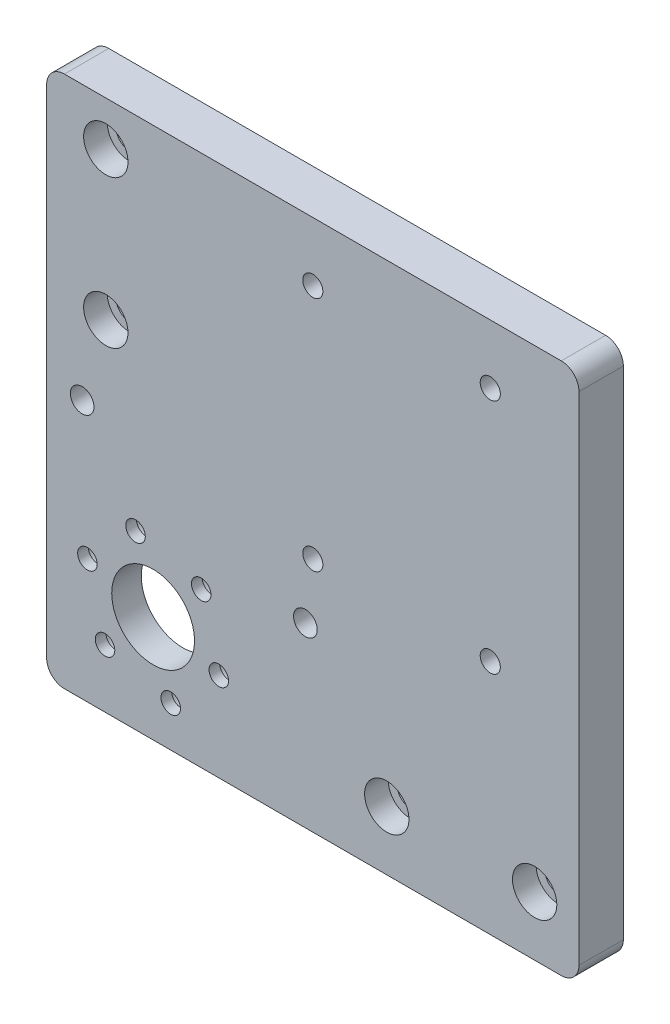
ISO-10303-21;
HEADER;
FILE_DESCRIPTION(('STEP AP214'),'2;1');
FILE_NAME('part.step','',(''),(''),'','','');
FILE_SCHEMA(('AUTOMOTIVE_DESIGN { 1 0 10303 214 1 1 1 1 }'));
ENDSEC;
DATA;
#1=APPLICATION_CONTEXT('core data for automotive mechanical design processes');
#2=APPLICATION_PROTOCOL_DEFINITION('international standard','automotive_design',2000,#1);
#3=PRODUCT_CONTEXT('',#1,'mechanical');
#4=PRODUCT('Part','Part','',(#3));
#5=PRODUCT_RELATED_PRODUCT_CATEGORY('part','',(#4));
#6=PRODUCT_DEFINITION_FORMATION('','',#4);
#7=PRODUCT_DEFINITION_CONTEXT('part definition',#1,'design');
#8=PRODUCT_DEFINITION('design','',#6,#7);
#9=PRODUCT_DEFINITION_SHAPE('','',#8);
#10=(LENGTH_UNIT() NAMED_UNIT(*) SI_UNIT(.MILLI.,.METRE.));
#11=(NAMED_UNIT(*) PLANE_ANGLE_UNIT() SI_UNIT($,.RADIAN.));
#12=(NAMED_UNIT(*) SI_UNIT($,.STERADIAN.) SOLID_ANGLE_UNIT());
#13=UNCERTAINTY_MEASURE_WITH_UNIT(LENGTH_MEASURE(1.E-05),#10,'distance_accuracy_value','');
#14=(GEOMETRIC_REPRESENTATION_CONTEXT(3) GLOBAL_UNCERTAINTY_ASSIGNED_CONTEXT((#13)) GLOBAL_UNIT_ASSIGNED_CONTEXT((#10,
#11,#12)) REPRESENTATION_CONTEXT('',''));
#15=CARTESIAN_POINT('',(0.,0.,0.));
#16=DIRECTION('',(0.,0.,1.));
#17=DIRECTION('',(1.,0.,0.));
#18=AXIS2_PLACEMENT_3D('',#15,#16,#17);
#19=CARTESIAN_POINT('',(-106.216294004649,-78.0471619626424,5.));
#20=DIRECTION('',(0.,0.,-1.));
#21=DIRECTION('',(-1.,0.,0.));
#22=AXIS2_PLACEMENT_3D('',#19,#20,#21);
#23=CYLINDRICAL_SURFACE('',#22,5.50000000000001);
#24=CARTESIAN_POINT('',(-106.216294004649,-78.0471619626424,5.));
#25=DIRECTION('',(0.,0.,-1.));
#26=DIRECTION('',(-1.,0.,0.));
#27=AXIS2_PLACEMENT_3D('',#24,#25,#26);
#28=CIRCLE('',#27,5.50000000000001);
#29=CARTESIAN_POINT('',(-111.716294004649,-78.0471619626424,5.));
#30=VERTEX_POINT('',#29);
#31=EDGE_CURVE('E148',#30,#30,#28,.F.);
#32=ORIENTED_EDGE('',*,*,#31,.F.);
#33=EDGE_LOOP('',(#32));
#34=FACE_BOUND('',#33,.T.);
#35=CARTESIAN_POINT('',(-106.216294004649,-78.0471619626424,11.4));
#36=DIRECTION('',(0.,0.,-1.));
#37=DIRECTION('',(-1.,0.,0.));
#38=AXIS2_PLACEMENT_3D('',#35,#36,#37);
#39=CIRCLE('',#38,5.50000000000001);
#40=CARTESIAN_POINT('',(-111.716294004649,-78.0471619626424,11.4));
#41=VERTEX_POINT('',#40);
#42=EDGE_CURVE('E165',#41,#41,#39,.F.);
#43=ORIENTED_EDGE('',*,*,#42,.T.);
#44=EDGE_LOOP('',(#43));
#45=FACE_BOUND('',#44,.T.);
#46=ADVANCED_FACE('F16',(#34,#45),#23,.F.);
#47=CARTESIAN_POINT('',(-100.263455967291,-100.263455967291,5.));
#48=DIRECTION('',(0.,0.,-1.));
#49=DIRECTION('',(-1.,0.,0.));
#50=AXIS2_PLACEMENT_3D('',#47,#48,#49);
#51=CYLINDRICAL_SURFACE('',#50,5.50000000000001);
#52=CARTESIAN_POINT('',(-100.263455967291,-100.263455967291,5.));
#53=DIRECTION('',(0.,0.,-1.));
#54=DIRECTION('',(-1.,0.,0.));
#55=AXIS2_PLACEMENT_3D('',#52,#53,#54);
#56=CIRCLE('',#55,5.50000000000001);
#57=CARTESIAN_POINT('',(-105.763455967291,-100.263455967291,5.));
#58=VERTEX_POINT('',#57);
#59=EDGE_CURVE('E145',#58,#58,#56,.F.);
#60=ORIENTED_EDGE('',*,*,#59,.F.);
#61=EDGE_LOOP('',(#60));
#62=FACE_BOUND('',#61,.T.);
#63=CARTESIAN_POINT('',(-100.263455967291,-100.263455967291,11.4));
#64=DIRECTION('',(0.,0.,-1.));
#65=DIRECTION('',(-1.,0.,0.));
#66=AXIS2_PLACEMENT_3D('',#63,#64,#65);
#67=CIRCLE('',#66,5.50000000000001);
#68=CARTESIAN_POINT('',(-105.763455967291,-100.263455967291,11.4));
#69=VERTEX_POINT('',#68);
#70=EDGE_CURVE('E162',#69,#69,#67,.F.);
#71=ORIENTED_EDGE('',*,*,#70,.T.);
#72=EDGE_LOOP('',(#71));
#73=FACE_BOUND('',#72,.T.);
#74=ADVANCED_FACE('F613',(#62,#73),#51,.F.);
#75=CARTESIAN_POINT('',(-78.047161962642,-106.216294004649,5.));
#76=DIRECTION('',(0.,0.,-1.));
#77=DIRECTION('',(-1.,0.,0.));
#78=AXIS2_PLACEMENT_3D('',#75,#76,#77);
#79=CYLINDRICAL_SURFACE('',#78,5.49999999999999);
#80=CARTESIAN_POINT('',(-78.047161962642,-106.216294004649,5.));
#81=DIRECTION('',(0.,0.,-1.));
#82=DIRECTION('',(-1.,0.,0.));
#83=AXIS2_PLACEMENT_3D('',#80,#81,#82);
#84=CIRCLE('',#83,5.49999999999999);
#85=CARTESIAN_POINT('',(-83.547161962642,-106.216294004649,5.));
#86=VERTEX_POINT('',#85);
#87=EDGE_CURVE('E142',#86,#86,#84,.F.);
#88=ORIENTED_EDGE('',*,*,#87,.F.);
#89=EDGE_LOOP('',(#88));
#90=FACE_BOUND('',#89,.T.);
#91=CARTESIAN_POINT('',(-78.047161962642,-106.216294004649,11.4));
#92=DIRECTION('',(0.,0.,-1.));
#93=DIRECTION('',(-1.,0.,0.));
#94=AXIS2_PLACEMENT_3D('',#91,#92,#93);
#95=CIRCLE('',#94,5.49999999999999);
#96=CARTESIAN_POINT('',(-83.547161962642,-106.216294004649,11.4));
#97=VERTEX_POINT('',#96);
#98=EDGE_CURVE('E159',#97,#97,#95,.F.);
#99=ORIENTED_EDGE('',*,*,#98,.T.);
#100=EDGE_LOOP('',(#99));
#101=FACE_BOUND('',#100,.T.);
#102=ADVANCED_FACE('F610',(#90,#101),#79,.F.);
#103=CARTESIAN_POINT('',(-61.7837059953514,-89.9528380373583,5.));
#104=DIRECTION('',(0.,0.,-1.));
#105=DIRECTION('',(-1.,0.,0.));
#106=AXIS2_PLACEMENT_3D('',#103,#104,#105);
#107=CYLINDRICAL_SURFACE('',#106,5.5);
#108=CARTESIAN_POINT('',(-61.7837059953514,-89.9528380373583,5.));
#109=DIRECTION('',(0.,0.,-1.));
#110=DIRECTION('',(-1.,0.,0.));
#111=AXIS2_PLACEMENT_3D('',#108,#109,#110);
#112=CIRCLE('',#111,5.5);
#113=CARTESIAN_POINT('',(-67.2837059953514,-89.9528380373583,5.));
#114=VERTEX_POINT('',#113);
#115=EDGE_CURVE('E139',#114,#114,#112,.F.);
#116=ORIENTED_EDGE('',*,*,#115,.F.);
#117=EDGE_LOOP('',(#116));
#118=FACE_BOUND('',#117,.T.);
#119=CARTESIAN_POINT('',(-61.7837059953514,-89.9528380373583,11.4));
#120=DIRECTION('',(0.,0.,-1.));
#121=DIRECTION('',(-1.,0.,0.));
#122=AXIS2_PLACEMENT_3D('',#119,#120,#121);
#123=CIRCLE('',#122,5.5);
#124=CARTESIAN_POINT('',(-67.2837059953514,-89.9528380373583,11.4));
#125=VERTEX_POINT('',#124);
#126=EDGE_CURVE('E156',#125,#125,#123,.F.);
#127=ORIENTED_EDGE('',*,*,#126,.T.);
#128=EDGE_LOOP('',(#127));
#129=FACE_BOUND('',#128,.T.);
#130=ADVANCED_FACE('F606',(#118,#129),#107,.F.);
#131=CARTESIAN_POINT('',(-67.7365440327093,-67.7365440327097,5.));
#132=DIRECTION('',(0.,0.,-1.));
#133=DIRECTION('',(-1.,0.,0.));
#134=AXIS2_PLACEMENT_3D('',#131,#132,#133);
#135=CYLINDRICAL_SURFACE('',#134,5.50000000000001);
#136=CARTESIAN_POINT('',(-67.7365440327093,-67.7365440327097,5.));
#137=DIRECTION('',(0.,0.,-1.));
#138=DIRECTION('',(-1.,0.,0.));
#139=AXIS2_PLACEMENT_3D('',#136,#137,#138);
#140=CIRCLE('',#139,5.50000000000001);
#141=CARTESIAN_POINT('',(-73.2365440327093,-67.7365440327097,5.));
#142=VERTEX_POINT('',#141);
#143=EDGE_CURVE('E136',#142,#142,#140,.F.);
#144=ORIENTED_EDGE('',*,*,#143,.F.);
#145=EDGE_LOOP('',(#144));
#146=FACE_BOUND('',#145,.T.);
#147=CARTESIAN_POINT('',(-67.7365440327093,-67.7365440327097,11.4));
#148=DIRECTION('',(0.,0.,-1.));
#149=DIRECTION('',(-1.,0.,0.));
#150=AXIS2_PLACEMENT_3D('',#147,#148,#149);
#151=CIRCLE('',#150,5.50000000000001);
#152=CARTESIAN_POINT('',(-73.2365440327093,-67.7365440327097,11.4));
#153=VERTEX_POINT('',#152);
#154=EDGE_CURVE('E153',#153,#153,#151,.F.);
#155=ORIENTED_EDGE('',*,*,#154,.T.);
#156=EDGE_LOOP('',(#155));
#157=FACE_BOUND('',#156,.T.);
#158=ADVANCED_FACE('F599',(#146,#157),#135,.F.);
#159=CARTESIAN_POINT('',(-89.952838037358,-61.7837059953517,5.));
#160=DIRECTION('',(0.,0.,-1.));
#161=DIRECTION('',(-1.,0.,0.));
#162=AXIS2_PLACEMENT_3D('',#159,#160,#161);
#163=CYLINDRICAL_SURFACE('',#162,5.50000000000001);
#164=CARTESIAN_POINT('',(-89.952838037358,-61.7837059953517,5.));
#165=DIRECTION('',(0.,0.,-1.));
#166=DIRECTION('',(-1.,0.,0.));
#167=AXIS2_PLACEMENT_3D('',#164,#165,#166);
#168=CIRCLE('',#167,5.50000000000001);
#169=CARTESIAN_POINT('',(-95.452838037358,-61.7837059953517,5.));
#170=VERTEX_POINT('',#169);
#171=EDGE_CURVE('E129',#170,#170,#168,.F.);
#172=ORIENTED_EDGE('',*,*,#171,.F.);
#173=EDGE_LOOP('',(#172));
#174=FACE_BOUND('',#173,.T.);
#175=CARTESIAN_POINT('',(-89.952838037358,-61.7837059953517,11.4));
#176=DIRECTION('',(0.,0.,-1.));
#177=DIRECTION('',(-1.,0.,0.));
#178=AXIS2_PLACEMENT_3D('',#175,#176,#177);
#179=CIRCLE('',#178,5.50000000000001);
#180=CARTESIAN_POINT('',(-95.452838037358,-61.7837059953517,11.4));
#181=VERTEX_POINT('',#180);
#182=EDGE_CURVE('E111',#181,#181,#179,.F.);
#183=ORIENTED_EDGE('',*,*,#182,.T.);
#184=EDGE_LOOP('',(#183));
#185=FACE_BOUND('',#184,.T.);
#186=ADVANCED_FACE('F592',(#174,#185),#163,.F.);
#187=CARTESIAN_POINT('',(-100.,-4.9999999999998,15.));
#188=DIRECTION('',(0.,0.,-1.));
#189=DIRECTION('',(-1.,0.,0.));
#190=AXIS2_PLACEMENT_3D('',#187,#188,#189);
#191=CYLINDRICAL_SURFACE('',#190,4.5);
#192=CARTESIAN_POINT('',(-100.,-4.9999999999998,0.));
#193=DIRECTION('',(0.,0.,-1.));
#194=DIRECTION('',(-1.,0.,0.));
#195=AXIS2_PLACEMENT_3D('',#192,#193,#194);
#196=CIRCLE('',#195,4.5);
#197=CARTESIAN_POINT('',(-104.5,-4.9999999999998,0.));
#198=VERTEX_POINT('',#197);
#199=EDGE_CURVE('E122',#198,#198,#196,.T.);
#200=ORIENTED_EDGE('',*,*,#199,.T.);
#201=EDGE_LOOP('',(#200));
#202=FACE_BOUND('',#201,.T.);
#203=CARTESIAN_POINT('',(-100.,-4.9999999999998,7.));
#204=DIRECTION('',(0.,0.,-1.));
#205=DIRECTION('',(-1.,0.,0.));
#206=AXIS2_PLACEMENT_3D('',#203,#204,#205);
#207=CIRCLE('',#206,4.5);
#208=CARTESIAN_POINT('',(-104.5,-4.9999999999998,7.));
#209=VERTEX_POINT('',#208);
#210=EDGE_CURVE('E171',#209,#209,#207,.T.);
#211=ORIENTED_EDGE('',*,*,#210,.F.);
#212=EDGE_LOOP('',(#211));
#213=FACE_BOUND('',#212,.T.);
#214=ADVANCED_FACE('F381',(#202,#213),#191,.F.);
#215=CARTESIAN_POINT('',(-4.99999999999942,-100.,15.));
#216=DIRECTION('',(0.,0.,-1.));
#217=DIRECTION('',(-1.,0.,0.));
#218=AXIS2_PLACEMENT_3D('',#215,#216,#217);
#219=CYLINDRICAL_SURFACE('',#218,4.50000000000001);
#220=CARTESIAN_POINT('',(-4.99999999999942,-100.,0.));
#221=DIRECTION('',(0.,0.,-1.));
#222=DIRECTION('',(-1.,0.,0.));
#223=AXIS2_PLACEMENT_3D('',#220,#221,#222);
#224=CIRCLE('',#223,4.50000000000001);
#225=CARTESIAN_POINT('',(-9.49999999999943,-100.,0.));
#226=VERTEX_POINT('',#225);
#227=EDGE_CURVE('E373',#226,#226,#224,.T.);
#228=ORIENTED_EDGE('',*,*,#227,.T.);
#229=EDGE_LOOP('',(#228));
#230=FACE_BOUND('',#229,.T.);
#231=CARTESIAN_POINT('',(-4.99999999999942,-100.,7.));
#232=DIRECTION('',(0.,0.,-1.));
#233=DIRECTION('',(-1.,0.,0.));
#234=AXIS2_PLACEMENT_3D('',#231,#232,#233);
#235=CIRCLE('',#234,4.50000000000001);
#236=CARTESIAN_POINT('',(-9.49999999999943,-100.,7.));
#237=VERTEX_POINT('',#236);
#238=EDGE_CURVE('E173',#237,#237,#235,.T.);
#239=ORIENTED_EDGE('',*,*,#238,.F.);
#240=EDGE_LOOP('',(#239));
#241=FACE_BOUND('',#240,.T.);
#242=ADVANCED_FACE('F591',(#230,#241),#219,.F.);
#243=CARTESIAN_POINT('',(-64.,-64.0000000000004,5.));
#244=DIRECTION('',(0.,0.,-1.));
#245=DIRECTION('',(-1.,0.,0.));
#246=AXIS2_PLACEMENT_3D('',#243,#244,#245);
#247=CYLINDRICAL_SURFACE('',#246,15.);
#248=DIRECTION('',(0.,0.,-1.));
#249=VECTOR('',#248,1.);
#250=CARTESIAN_POINT('',(-49.,-64.0000000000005,5.));
#251=LINE('',#250,#249);
#252=CARTESIAN_POINT('',(-49.,-64.0000000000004,0.));
#253=VERTEX_POINT('',#252);
#254=CARTESIAN_POINT('',(-49.,-64.0000000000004,5.));
#255=VERTEX_POINT('',#254);
#256=EDGE_CURVE('E100',#253,#255,#251,.F.);
#257=ORIENTED_EDGE('',*,*,#256,.T.);
#258=CARTESIAN_POINT('',(-64.,-64.0000000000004,5.));
#259=DIRECTION('',(0.,0.,-1.));
#260=DIRECTION('',(-1.,0.,0.));
#261=AXIS2_PLACEMENT_3D('',#258,#259,#260);
#262=CIRCLE('',#261,15.);
#263=CARTESIAN_POINT('',(-64.0000000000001,-49.0000000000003,5.));
#264=VERTEX_POINT('',#263);
#265=EDGE_CURVE('E104',#264,#255,#262,.T.);
#266=ORIENTED_EDGE('',*,*,#265,.F.);
#267=DIRECTION('',(0.,0.,1.));
#268=VECTOR('',#267,1.);
#269=CARTESIAN_POINT('',(-64.0000000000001,-49.0000000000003,5.));
#270=LINE('',#269,#268);
#271=CARTESIAN_POINT('',(-64.0000000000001,-49.0000000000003,0.));
#272=VERTEX_POINT('',#271);
#273=EDGE_CURVE('E95',#264,#272,#270,.F.);
#274=ORIENTED_EDGE('',*,*,#273,.T.);
#275=CARTESIAN_POINT('',(-64.,-64.0000000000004,0.));
#276=DIRECTION('',(0.,0.,-1.));
#277=DIRECTION('',(-1.,0.,0.));
#278=AXIS2_PLACEMENT_3D('',#275,#276,#277);
#279=CIRCLE('',#278,15.);
#280=EDGE_CURVE('E107',#272,#253,#279,.T.);
#281=ORIENTED_EDGE('',*,*,#280,.T.);
#282=EDGE_LOOP('',(#257,#266,#274,#281));
#283=FACE_BOUND('',#282,.T.);
#284=ADVANCED_FACE('F102',(#283),#247,.F.);
#285=CARTESIAN_POINT('',(-100.,45.0000000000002,15.));
#286=DIRECTION('',(0.,0.,-1.));
#287=DIRECTION('',(-1.,0.,0.));
#288=AXIS2_PLACEMENT_3D('',#285,#286,#287);
#289=CYLINDRICAL_SURFACE('',#288,4.5);
#290=CARTESIAN_POINT('',(-100.,45.0000000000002,0.));
#291=DIRECTION('',(0.,0.,-1.));
#292=DIRECTION('',(-1.,0.,0.));
#293=AXIS2_PLACEMENT_3D('',#290,#291,#292);
#294=CIRCLE('',#293,4.5);
#295=CARTESIAN_POINT('',(-104.5,45.0000000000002,0.));
#296=VERTEX_POINT('',#295);
#297=EDGE_CURVE('E368',#296,#296,#294,.T.);
#298=ORIENTED_EDGE('',*,*,#297,.T.);
#299=EDGE_LOOP('',(#298));
#300=FACE_BOUND('',#299,.T.);
#301=CARTESIAN_POINT('',(-100.,45.0000000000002,7.));
#302=DIRECTION('',(0.,0.,-1.));
#303=DIRECTION('',(-1.,0.,0.));
#304=AXIS2_PLACEMENT_3D('',#301,#302,#303);
#305=CIRCLE('',#304,4.5);
#306=CARTESIAN_POINT('',(-104.5,45.0000000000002,7.));
#307=VERTEX_POINT('',#306);
#308=EDGE_CURVE('E168',#307,#307,#305,.T.);
#309=ORIENTED_EDGE('',*,*,#308,.F.);
#310=EDGE_LOOP('',(#309));
#311=FACE_BOUND('',#310,.T.);
#312=ADVANCED_FACE('F184',(#300,#311),#289,.F.);
#313=CARTESIAN_POINT('',(45.0000000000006,-99.9999999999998,15.));
#314=DIRECTION('',(0.,0.,-1.));
#315=DIRECTION('',(-1.,0.,0.));
#316=AXIS2_PLACEMENT_3D('',#313,#314,#315);
#317=CYLINDRICAL_SURFACE('',#316,4.49999999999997);
#318=CARTESIAN_POINT('',(45.0000000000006,-99.9999999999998,0.));
#319=DIRECTION('',(0.,0.,-1.));
#320=DIRECTION('',(-1.,0.,0.));
#321=AXIS2_PLACEMENT_3D('',#318,#319,#320);
#322=CIRCLE('',#321,4.49999999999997);
#323=CARTESIAN_POINT('',(40.5000000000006,-99.9999999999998,0.));
#324=VERTEX_POINT('',#323);
#325=EDGE_CURVE('E363',#324,#324,#322,.T.);
#326=ORIENTED_EDGE('',*,*,#325,.T.);
#327=EDGE_LOOP('',(#326));
#328=FACE_BOUND('',#327,.T.);
#329=CARTESIAN_POINT('',(45.0000000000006,-99.9999999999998,7.));
#330=DIRECTION('',(0.,0.,-1.));
#331=DIRECTION('',(-1.,0.,0.));
#332=AXIS2_PLACEMENT_3D('',#329,#330,#331);
#333=CIRCLE('',#332,4.49999999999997);
#334=CARTESIAN_POINT('',(40.5000000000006,-99.9999999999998,7.));
#335=VERTEX_POINT('',#334);
#336=EDGE_CURVE('E19',#335,#335,#333,.T.);
#337=ORIENTED_EDGE('',*,*,#336,.F.);
#338=EDGE_LOOP('',(#337));
#339=FACE_BOUND('',#338,.T.);
#340=ADVANCED_FACE('F182',(#328,#339),#317,.F.);
#341=CARTESIAN_POINT('',(45.0000000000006,-99.9999999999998,7.));
#342=DIRECTION('',(0.,0.,1.));
#343=DIRECTION('',(1.,0.,0.));
#344=AXIS2_PLACEMENT_3D('',#341,#342,#343);
#345=PLANE('',#344);
#346=CARTESIAN_POINT('',(45.0000000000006,-99.9999999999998,7.));
#347=DIRECTION('',(0.,0.,1.));
#348=DIRECTION('',(1.,0.,0.));
#349=AXIS2_PLACEMENT_3D('',#346,#347,#348);
#350=CIRCLE('',#349,7.5);
#351=CARTESIAN_POINT('',(52.5000000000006,-99.9999999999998,7.));
#352=VERTEX_POINT('',#351);
#353=EDGE_CURVE('E357',#352,#352,#350,.T.);
#354=ORIENTED_EDGE('',*,*,#353,.T.);
#355=EDGE_LOOP('',(#354));
#356=FACE_BOUND('',#355,.T.);
#357=ORIENTED_EDGE('',*,*,#336,.T.);
#358=EDGE_LOOP('',(#357));
#359=FACE_BOUND('',#358,.T.);
#360=ADVANCED_FACE('F180',(#356,#359),#345,.T.);
#361=CARTESIAN_POINT('',(-4.99999999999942,-100.,7.));
#362=DIRECTION('',(0.,0.,1.));
#363=DIRECTION('',(1.,0.,0.));
#364=AXIS2_PLACEMENT_3D('',#361,#362,#363);
#365=PLANE('',#364);
#366=CARTESIAN_POINT('',(-4.99999999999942,-100.,7.));
#367=DIRECTION('',(0.,0.,1.));
#368=DIRECTION('',(1.,0.,0.));
#369=AXIS2_PLACEMENT_3D('',#366,#367,#368);
#370=CIRCLE('',#369,7.5);
#371=CARTESIAN_POINT('',(2.50000000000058,-100.,7.));
#372=VERTEX_POINT('',#371);
#373=EDGE_CURVE('E354',#372,#372,#370,.T.);
#374=ORIENTED_EDGE('',*,*,#373,.T.);
#375=EDGE_LOOP('',(#374));
#376=FACE_BOUND('',#375,.T.);
#377=ORIENTED_EDGE('',*,*,#238,.T.);
#378=EDGE_LOOP('',(#377));
#379=FACE_BOUND('',#378,.T.);
#380=ADVANCED_FACE('F192',(#376,#379),#365,.T.);
#381=CARTESIAN_POINT('',(-100.,-4.9999999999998,7.));
#382=DIRECTION('',(0.,0.,1.));
#383=DIRECTION('',(1.,0.,0.));
#384=AXIS2_PLACEMENT_3D('',#381,#382,#383);
#385=PLANE('',#384);
#386=CARTESIAN_POINT('',(-100.,-4.9999999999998,7.));
#387=DIRECTION('',(0.,0.,1.));
#388=DIRECTION('',(1.,0.,0.));
#389=AXIS2_PLACEMENT_3D('',#386,#387,#388);
#390=CIRCLE('',#389,7.49999999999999);
#391=CARTESIAN_POINT('',(-92.5,-4.9999999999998,7.));
#392=VERTEX_POINT('',#391);
#393=EDGE_CURVE('E356',#392,#392,#390,.T.);
#394=ORIENTED_EDGE('',*,*,#393,.T.);
#395=EDGE_LOOP('',(#394));
#396=FACE_BOUND('',#395,.T.);
#397=ORIENTED_EDGE('',*,*,#210,.T.);
#398=EDGE_LOOP('',(#397));
#399=FACE_BOUND('',#398,.T.);
#400=ADVANCED_FACE('F343',(#396,#399),#385,.T.);
#401=CARTESIAN_POINT('',(-100.,45.0000000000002,7.));
#402=DIRECTION('',(0.,0.,1.));
#403=DIRECTION('',(1.,0.,0.));
#404=AXIS2_PLACEMENT_3D('',#401,#402,#403);
#405=PLANE('',#404);
#406=CARTESIAN_POINT('',(-100.,45.0000000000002,7.));
#407=DIRECTION('',(0.,0.,1.));
#408=DIRECTION('',(1.,0.,0.));
#409=AXIS2_PLACEMENT_3D('',#406,#407,#408);
#410=CIRCLE('',#409,7.49999999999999);
#411=CARTESIAN_POINT('',(-92.5,45.0000000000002,7.));
#412=VERTEX_POINT('',#411);
#413=EDGE_CURVE('E360',#412,#412,#410,.T.);
#414=ORIENTED_EDGE('',*,*,#413,.T.);
#415=EDGE_LOOP('',(#414));
#416=FACE_BOUND('',#415,.T.);
#417=ORIENTED_EDGE('',*,*,#308,.T.);
#418=EDGE_LOOP('',(#417));
#419=FACE_BOUND('',#418,.T.);
#420=ADVANCED_FACE('F339',(#416,#419),#405,.T.);
#421=CARTESIAN_POINT('',(-102.916294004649,-78.0471619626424,11.4));
#422=DIRECTION('',(0.,0.,1.));
#423=DIRECTION('',(1.,0.,0.));
#424=AXIS2_PLACEMENT_3D('',#421,#422,#423);
#425=PLANE('',#424);
#426=ORIENTED_EDGE('',*,*,#42,.F.);
#427=EDGE_LOOP('',(#426));
#428=FACE_BOUND('',#427,.T.);
#429=CARTESIAN_POINT('',(-106.216294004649,-78.0471619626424,11.4));
#430=DIRECTION('',(0.,0.,-1.));
#431=DIRECTION('',(-1.,0.,0.));
#432=AXIS2_PLACEMENT_3D('',#429,#430,#431);
#433=CIRCLE('',#432,3.3);
#434=CARTESIAN_POINT('',(-109.516294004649,-78.0471619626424,11.4));
#435=VERTEX_POINT('',#434);
#436=EDGE_CURVE('E424',#435,#435,#433,.F.);
#437=ORIENTED_EDGE('',*,*,#436,.T.);
#438=EDGE_LOOP('',(#437));
#439=FACE_BOUND('',#438,.T.);
#440=ADVANCED_FACE('F335',(#428,#439),#425,.F.);
#441=CARTESIAN_POINT('',(-96.9634559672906,-100.263455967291,11.4));
#442=DIRECTION('',(0.,0.,1.));
#443=DIRECTION('',(1.,0.,0.));
#444=AXIS2_PLACEMENT_3D('',#441,#442,#443);
#445=PLANE('',#444);
#446=ORIENTED_EDGE('',*,*,#70,.F.);
#447=EDGE_LOOP('',(#446));
#448=FACE_BOUND('',#447,.T.);
#449=CARTESIAN_POINT('',(-100.263455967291,-100.263455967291,11.4));
#450=DIRECTION('',(0.,0.,-1.));
#451=DIRECTION('',(-1.,0.,0.));
#452=AXIS2_PLACEMENT_3D('',#449,#450,#451);
#453=CIRCLE('',#452,3.3);
#454=CARTESIAN_POINT('',(-103.563455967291,-100.263455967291,11.4));
#455=VERTEX_POINT('',#454);
#456=EDGE_CURVE('E421',#455,#455,#453,.F.);
#457=ORIENTED_EDGE('',*,*,#456,.T.);
#458=EDGE_LOOP('',(#457));
#459=FACE_BOUND('',#458,.T.);
#460=ADVANCED_FACE('F331',(#448,#459),#445,.F.);
#461=CARTESIAN_POINT('',(-74.747161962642,-106.216294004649,11.4));
#462=DIRECTION('',(0.,0.,1.));
#463=DIRECTION('',(1.,0.,0.));
#464=AXIS2_PLACEMENT_3D('',#461,#462,#463);
#465=PLANE('',#464);
#466=ORIENTED_EDGE('',*,*,#98,.F.);
#467=EDGE_LOOP('',(#466));
#468=FACE_BOUND('',#467,.T.);
#469=CARTESIAN_POINT('',(-78.047161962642,-106.216294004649,11.4));
#470=DIRECTION('',(0.,0.,-1.));
#471=DIRECTION('',(-1.,0.,0.));
#472=AXIS2_PLACEMENT_3D('',#469,#470,#471);
#473=CIRCLE('',#472,3.3);
#474=CARTESIAN_POINT('',(-81.347161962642,-106.216294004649,11.4));
#475=VERTEX_POINT('',#474);
#476=EDGE_CURVE('E418',#475,#475,#473,.F.);
#477=ORIENTED_EDGE('',*,*,#476,.T.);
#478=EDGE_LOOP('',(#477));
#479=FACE_BOUND('',#478,.T.);
#480=ADVANCED_FACE('F327',(#468,#479),#465,.F.);
#481=CARTESIAN_POINT('',(-58.4837059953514,-89.9528380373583,11.4));
#482=DIRECTION('',(0.,0.,1.));
#483=DIRECTION('',(1.,0.,0.));
#484=AXIS2_PLACEMENT_3D('',#481,#482,#483);
#485=PLANE('',#484);
#486=ORIENTED_EDGE('',*,*,#126,.F.);
#487=EDGE_LOOP('',(#486));
#488=FACE_BOUND('',#487,.T.);
#489=CARTESIAN_POINT('',(-61.7837059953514,-89.9528380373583,11.4));
#490=DIRECTION('',(0.,0.,-1.));
#491=DIRECTION('',(-1.,0.,0.));
#492=AXIS2_PLACEMENT_3D('',#489,#490,#491);
#493=CIRCLE('',#492,3.3);
#494=CARTESIAN_POINT('',(-65.0837059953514,-89.9528380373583,11.4));
#495=VERTEX_POINT('',#494);
#496=EDGE_CURVE('E415',#495,#495,#493,.F.);
#497=ORIENTED_EDGE('',*,*,#496,.T.);
#498=EDGE_LOOP('',(#497));
#499=FACE_BOUND('',#498,.T.);
#500=ADVANCED_FACE('F323',(#488,#499),#485,.F.);
#501=CARTESIAN_POINT('',(-64.4365440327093,-67.7365440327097,11.4));
#502=DIRECTION('',(0.,0.,1.));
#503=DIRECTION('',(1.,0.,0.));
#504=AXIS2_PLACEMENT_3D('',#501,#502,#503);
#505=PLANE('',#504);
#506=ORIENTED_EDGE('',*,*,#154,.F.);
#507=EDGE_LOOP('',(#506));
#508=FACE_BOUND('',#507,.T.);
#509=CARTESIAN_POINT('',(-67.7365440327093,-67.7365440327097,11.4));
#510=DIRECTION('',(0.,0.,-1.));
#511=DIRECTION('',(-1.,0.,0.));
#512=AXIS2_PLACEMENT_3D('',#509,#510,#511);
#513=CIRCLE('',#512,3.3);
#514=CARTESIAN_POINT('',(-71.0365440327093,-67.7365440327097,11.4));
#515=VERTEX_POINT('',#514);
#516=EDGE_CURVE('E409',#515,#515,#513,.F.);
#517=ORIENTED_EDGE('',*,*,#516,.T.);
#518=EDGE_LOOP('',(#517));
#519=FACE_BOUND('',#518,.T.);
#520=ADVANCED_FACE('F319',(#508,#519),#505,.F.);
#521=CARTESIAN_POINT('',(-86.652838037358,-61.7837059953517,11.4));
#522=DIRECTION('',(0.,0.,1.));
#523=DIRECTION('',(1.,0.,0.));
#524=AXIS2_PLACEMENT_3D('',#521,#522,#523);
#525=PLANE('',#524);
#526=ORIENTED_EDGE('',*,*,#182,.F.);
#527=EDGE_LOOP('',(#526));
#528=FACE_BOUND('',#527,.T.);
#529=CARTESIAN_POINT('',(-89.952838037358,-61.7837059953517,11.4));
#530=DIRECTION('',(0.,0.,-1.));
#531=DIRECTION('',(-1.,0.,0.));
#532=AXIS2_PLACEMENT_3D('',#529,#530,#531);
#533=CIRCLE('',#532,3.3);
#534=CARTESIAN_POINT('',(-93.252838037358,-61.7837059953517,11.4));
#535=VERTEX_POINT('',#534);
#536=EDGE_CURVE('E405',#535,#535,#533,.F.);
#537=ORIENTED_EDGE('',*,*,#536,.T.);
#538=EDGE_LOOP('',(#537));
#539=FACE_BOUND('',#538,.T.);
#540=ADVANCED_FACE('F316',(#528,#539),#525,.F.);
#541=CARTESIAN_POINT('',(-49.,-129.157125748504,5.));
#542=DIRECTION('',(1.,0.,0.));
#543=DIRECTION('',(0.,0.,-1.));
#544=AXIS2_PLACEMENT_3D('',#541,#542,#543);
#545=PLANE('',#544);
#546=ORIENTED_EDGE('',*,*,#256,.F.);
#547=DIRECTION('',(0.,1.,0.));
#548=VECTOR('',#547,1.);
#549=CARTESIAN_POINT('',(-49.,-114.,0.));
#550=LINE('',#549,#548);
#551=CARTESIAN_POINT('',(-49.,-120.,0.));
#552=VERTEX_POINT('',#551);
#553=EDGE_CURVE('E371',#253,#552,#550,.F.);
#554=ORIENTED_EDGE('',*,*,#553,.T.);
#555=DIRECTION('',(0.,0.,1.));
#556=VECTOR('',#555,1.);
#557=CARTESIAN_POINT('',(-49.,-120.,15.));
#558=LINE('',#557,#556);
#559=CARTESIAN_POINT('',(-49.,-120.,5.));
#560=VERTEX_POINT('',#559);
#561=EDGE_CURVE('E118',#552,#560,#558,.T.);
#562=ORIENTED_EDGE('',*,*,#561,.T.);
#563=DIRECTION('',(0.,1.,0.));
#564=VECTOR('',#563,1.);
#565=CARTESIAN_POINT('',(-49.,-64.0000000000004,5.));
#566=LINE('',#565,#564);
#567=EDGE_CURVE('E115',#255,#560,#566,.F.);
#568=ORIENTED_EDGE('',*,*,#567,.F.);
#569=EDGE_LOOP('',(#546,#554,#562,#568));
#570=FACE_BOUND('',#569,.T.);
#571=ADVANCED_FACE('F116',(#570),#545,.F.);
#572=CARTESIAN_POINT('',(-132.054371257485,-49.0000000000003,5.));
#573=DIRECTION('',(0.,1.,0.));
#574=DIRECTION('',(0.,0.,1.));
#575=AXIS2_PLACEMENT_3D('',#572,#573,#574);
#576=PLANE('',#575);
#577=ORIENTED_EDGE('',*,*,#273,.F.);
#578=DIRECTION('',(-1.,0.,0.));
#579=VECTOR('',#578,1.);
#580=CARTESIAN_POINT('',(-64.,-49.0000000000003,5.));
#581=LINE('',#580,#579);
#582=CARTESIAN_POINT('',(-120.,-49.0000000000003,5.));
#583=VERTEX_POINT('',#582);
#584=EDGE_CURVE('E127',#583,#264,#581,.F.);
#585=ORIENTED_EDGE('',*,*,#584,.F.);
#586=DIRECTION('',(0.,0.,1.));
#587=VECTOR('',#586,1.);
#588=CARTESIAN_POINT('',(-120.,-49.0000000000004,15.));
#589=LINE('',#588,#587);
#590=CARTESIAN_POINT('',(-120.,-49.0000000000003,0.));
#591=VERTEX_POINT('',#590);
#592=EDGE_CURVE('E502',#583,#591,#589,.F.);
#593=ORIENTED_EDGE('',*,*,#592,.T.);
#594=DIRECTION('',(1.,0.,0.));
#595=VECTOR('',#594,1.);
#596=CARTESIAN_POINT('',(-114.,-49.0000000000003,0.));
#597=LINE('',#596,#595);
#598=EDGE_CURVE('E372',#591,#272,#597,.T.);
#599=ORIENTED_EDGE('',*,*,#598,.T.);
#600=EDGE_LOOP('',(#577,#585,#593,#599));
#601=FACE_BOUND('',#600,.T.);
#602=ADVANCED_FACE('F311',(#601),#576,.F.);
#603=CARTESIAN_POINT('',(-64.,-64.0000000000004,5.));
#604=DIRECTION('',(0.,0.,-1.));
#605=DIRECTION('',(-1.,0.,0.));
#606=AXIS2_PLACEMENT_3D('',#603,#604,#605);
#607=PLANE('',#606);
#608=ORIENTED_EDGE('',*,*,#265,.T.);
#609=ORIENTED_EDGE('',*,*,#567,.T.);
#610=DIRECTION('',(-1.,0.,0.));
#611=VECTOR('',#610,1.);
#612=CARTESIAN_POINT('',(-114.,-120.,5.));
#613=LINE('',#612,#611);
#614=CARTESIAN_POINT('',(-114.,-120.,5.));
#615=VERTEX_POINT('',#614);
#616=EDGE_CURVE('E476',#560,#615,#613,.T.);
#617=ORIENTED_EDGE('',*,*,#616,.T.);
#618=CARTESIAN_POINT('',(-114.,-114.,5.));
#619=DIRECTION('',(0.,0.,-1.));
#620=DIRECTION('',(-1.,0.,0.));
#621=AXIS2_PLACEMENT_3D('',#618,#619,#620);
#622=CIRCLE('',#621,5.99999999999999);
#623=CARTESIAN_POINT('',(-120.,-114.,5.));
#624=VERTEX_POINT('',#623);
#625=EDGE_CURVE('E477',#624,#615,#622,.F.);
#626=ORIENTED_EDGE('',*,*,#625,.F.);
#627=DIRECTION('',(0.,1.,0.));
#628=VECTOR('',#627,1.);
#629=CARTESIAN_POINT('',(-120.,54.0000000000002,5.));
#630=LINE('',#629,#628);
#631=EDGE_CURVE('E507',#624,#583,#630,.T.);
#632=ORIENTED_EDGE('',*,*,#631,.T.);
#633=ORIENTED_EDGE('',*,*,#584,.T.);
#634=EDGE_LOOP('',(#608,#609,#617,#626,#632,#633));
#635=FACE_BOUND('',#634,.T.);
#636=CARTESIAN_POINT('',(-84.,-84.0000000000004,5.));
#637=DIRECTION('',(0.,0.,-1.));
#638=DIRECTION('',(-1.,0.,0.));
#639=AXIS2_PLACEMENT_3D('',#636,#637,#638);
#640=CIRCLE('',#639,14.);
#641=CARTESIAN_POINT('',(-98.,-84.0000000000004,5.));
#642=VERTEX_POINT('',#641);
#643=EDGE_CURVE('E461',#642,#642,#640,.F.);
#644=ORIENTED_EDGE('',*,*,#643,.T.);
#645=EDGE_LOOP('',(#644));
#646=FACE_BOUND('',#645,.T.);
#647=ORIENTED_EDGE('',*,*,#171,.T.);
#648=EDGE_LOOP('',(#647));
#649=FACE_BOUND('',#648,.T.);
#650=ORIENTED_EDGE('',*,*,#143,.T.);
#651=EDGE_LOOP('',(#650));
#652=FACE_BOUND('',#651,.T.);
#653=ORIENTED_EDGE('',*,*,#115,.T.);
#654=EDGE_LOOP('',(#653));
#655=FACE_BOUND('',#654,.T.);
#656=ORIENTED_EDGE('',*,*,#87,.T.);
#657=EDGE_LOOP('',(#656));
#658=FACE_BOUND('',#657,.T.);
#659=ORIENTED_EDGE('',*,*,#59,.T.);
#660=EDGE_LOOP('',(#659));
#661=FACE_BOUND('',#660,.T.);
#662=ORIENTED_EDGE('',*,*,#31,.T.);
#663=EDGE_LOOP('',(#662));
#664=FACE_BOUND('',#663,.T.);
#665=ADVANCED_FACE('F124',(#635,#646,#649,#652,#655,#658,#661,#664),#607,.T.);
#666=CARTESIAN_POINT('',(-114.,-114.,0.));
#667=DIRECTION('',(0.,0.,1.));
#668=DIRECTION('',(1.,0.,0.));
#669=AXIS2_PLACEMENT_3D('',#666,#667,#668);
#670=PLANE('',#669);
#671=CARTESIAN_POINT('',(-32.5,-60.0000000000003,0.));
#672=DIRECTION('',(0.,0.,-1.));
#673=DIRECTION('',(-1.,0.,0.));
#674=AXIS2_PLACEMENT_3D('',#671,#672,#673);
#675=CIRCLE('',#674,4.);
#676=CARTESIAN_POINT('',(-36.5,-60.0000000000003,0.));
#677=VERTEX_POINT('',#676);
#678=EDGE_CURVE('E458',#677,#677,#675,.F.);
#679=ORIENTED_EDGE('',*,*,#678,.T.);
#680=EDGE_LOOP('',(#679));
#681=FACE_BOUND('',#680,.T.);
#682=ORIENTED_EDGE('',*,*,#325,.F.);
#683=EDGE_LOOP('',(#682));
#684=FACE_BOUND('',#683,.T.);
#685=ORIENTED_EDGE('',*,*,#297,.F.);
#686=EDGE_LOOP('',(#685));
#687=FACE_BOUND('',#686,.T.);
#688=ORIENTED_EDGE('',*,*,#553,.F.);
#689=ORIENTED_EDGE('',*,*,#280,.F.);
#690=ORIENTED_EDGE('',*,*,#598,.F.);
#691=DIRECTION('',(0.,1.,0.));
#692=VECTOR('',#691,1.);
#693=CARTESIAN_POINT('',(-120.,54.0000000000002,0.));
#694=LINE('',#693,#692);
#695=CARTESIAN_POINT('',(-120.,54.0000000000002,0.));
#696=VERTEX_POINT('',#695);
#697=EDGE_CURVE('E464',#591,#696,#694,.T.);
#698=ORIENTED_EDGE('',*,*,#697,.T.);
#699=CARTESIAN_POINT('',(-114.,54.0000000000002,0.));
#700=DIRECTION('',(0.,0.,-1.));
#701=DIRECTION('',(-1.,0.,0.));
#702=AXIS2_PLACEMENT_3D('',#699,#700,#701);
#703=CIRCLE('',#702,6.00000000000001);
#704=CARTESIAN_POINT('',(-114.,60.0000000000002,0.));
#705=VERTEX_POINT('',#704);
#706=EDGE_CURVE('E465',#705,#696,#703,.F.);
#707=ORIENTED_EDGE('',*,*,#706,.F.);
#708=DIRECTION('',(1.,0.,0.));
#709=VECTOR('',#708,1.);
#710=CARTESIAN_POINT('',(54.,60.0000000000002,0.));
#711=LINE('',#710,#709);
#712=CARTESIAN_POINT('',(54.,60.0000000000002,0.));
#713=VERTEX_POINT('',#712);
#714=EDGE_CURVE('E468',#705,#713,#711,.T.);
#715=ORIENTED_EDGE('',*,*,#714,.T.);
#716=CARTESIAN_POINT('',(54.,54.0000000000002,0.));
#717=DIRECTION('',(0.,0.,-1.));
#718=DIRECTION('',(-1.,0.,0.));
#719=AXIS2_PLACEMENT_3D('',#716,#717,#718);
#720=CIRCLE('',#719,6.);
#721=CARTESIAN_POINT('',(60.,54.0000000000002,0.));
#722=VERTEX_POINT('',#721);
#723=EDGE_CURVE('E469',#722,#713,#720,.F.);
#724=ORIENTED_EDGE('',*,*,#723,.F.);
#725=DIRECTION('',(0.,-1.,0.));
#726=VECTOR('',#725,1.);
#727=CARTESIAN_POINT('',(60.,-114.,0.));
#728=LINE('',#727,#726);
#729=CARTESIAN_POINT('',(60.,-114.,0.));
#730=VERTEX_POINT('',#729);
#731=EDGE_CURVE('E472',#722,#730,#728,.T.);
#732=ORIENTED_EDGE('',*,*,#731,.T.);
#733=CARTESIAN_POINT('',(54.,-114.,0.));
#734=DIRECTION('',(0.,0.,-1.));
#735=DIRECTION('',(-1.,0.,0.));
#736=AXIS2_PLACEMENT_3D('',#733,#734,#735);
#737=CIRCLE('',#736,6.00000000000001);
#738=CARTESIAN_POINT('',(54.,-120.,0.));
#739=VERTEX_POINT('',#738);
#740=EDGE_CURVE('E473',#739,#730,#737,.F.);
#741=ORIENTED_EDGE('',*,*,#740,.F.);
#742=DIRECTION('',(-1.,0.,0.));
#743=VECTOR('',#742,1.);
#744=CARTESIAN_POINT('',(-114.,-120.,0.));
#745=LINE('',#744,#743);
#746=EDGE_CURVE('E482',#739,#552,#745,.T.);
#747=ORIENTED_EDGE('',*,*,#746,.T.);
#748=EDGE_LOOP('',(#688,#689,#690,#698,#707,#715,#724,#732,#741,#747));
#749=FACE_BOUND('',#748,.T.);
#750=ORIENTED_EDGE('',*,*,#227,.F.);
#751=EDGE_LOOP('',(#750));
#752=FACE_BOUND('',#751,.T.);
#753=ORIENTED_EDGE('',*,*,#199,.F.);
#754=EDGE_LOOP('',(#753));
#755=FACE_BOUND('',#754,.T.);
#756=CARTESIAN_POINT('',(-30.,-40.,0.));
#757=DIRECTION('',(0.,0.,1.));
#758=DIRECTION('',(1.,0.,0.));
#759=AXIS2_PLACEMENT_3D('',#756,#757,#758);
#760=CIRCLE('',#759,3.39999999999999);
#761=CARTESIAN_POINT('',(-26.6,-40.,0.));
#762=VERTEX_POINT('',#761);
#763=EDGE_CURVE('E388',#762,#762,#760,.T.);
#764=ORIENTED_EDGE('',*,*,#763,.T.);
#765=EDGE_LOOP('',(#764));
#766=FACE_BOUND('',#765,.T.);
#767=CARTESIAN_POINT('',(30.,-40.,0.));
#768=DIRECTION('',(0.,0.,1.));
#769=DIRECTION('',(1.,0.,0.));
#770=AXIS2_PLACEMENT_3D('',#767,#768,#769);
#771=CIRCLE('',#770,3.39999999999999);
#772=CARTESIAN_POINT('',(33.4,-40.,0.));
#773=VERTEX_POINT('',#772);
#774=EDGE_CURVE('E392',#773,#773,#771,.T.);
#775=ORIENTED_EDGE('',*,*,#774,.T.);
#776=EDGE_LOOP('',(#775));
#777=FACE_BOUND('',#776,.T.);
#778=CARTESIAN_POINT('',(30.,40.,0.));
#779=DIRECTION('',(0.,0.,1.));
#780=DIRECTION('',(1.,0.,0.));
#781=AXIS2_PLACEMENT_3D('',#778,#779,#780);
#782=CIRCLE('',#781,3.39999999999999);
#783=CARTESIAN_POINT('',(33.4,40.,0.));
#784=VERTEX_POINT('',#783);
#785=EDGE_CURVE('E396',#784,#784,#782,.T.);
#786=ORIENTED_EDGE('',*,*,#785,.T.);
#787=EDGE_LOOP('',(#786));
#788=FACE_BOUND('',#787,.T.);
#789=CARTESIAN_POINT('',(-30.,40.,0.));
#790=DIRECTION('',(0.,0.,1.));
#791=DIRECTION('',(1.,0.,0.));
#792=AXIS2_PLACEMENT_3D('',#789,#790,#791);
#793=CIRCLE('',#792,3.39999999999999);
#794=CARTESIAN_POINT('',(-26.6,40.,0.));
#795=VERTEX_POINT('',#794);
#796=EDGE_CURVE('E400',#795,#795,#793,.T.);
#797=ORIENTED_EDGE('',*,*,#796,.T.);
#798=EDGE_LOOP('',(#797));
#799=FACE_BOUND('',#798,.T.);
#800=CARTESIAN_POINT('',(-108.,-32.5000000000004,0.));
#801=DIRECTION('',(0.,0.,-1.));
#802=DIRECTION('',(-1.,0.,0.));
#803=AXIS2_PLACEMENT_3D('',#800,#801,#802);
#804=CIRCLE('',#803,4.);
#805=CARTESIAN_POINT('',(-112.,-32.5000000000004,0.));
#806=VERTEX_POINT('',#805);
#807=EDGE_CURVE('E403',#806,#806,#804,.F.);
#808=ORIENTED_EDGE('',*,*,#807,.T.);
#809=EDGE_LOOP('',(#808));
#810=FACE_BOUND('',#809,.T.);
#811=ADVANCED_FACE('F304',(#681,#684,#687,#749,#752,#755,#766,#777,#788,#799,#810),#670,.F.);
#812=CARTESIAN_POINT('',(45.0000000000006,-99.9999999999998,7.));
#813=DIRECTION('',(0.,0.,1.));
#814=DIRECTION('',(1.,0.,0.));
#815=AXIS2_PLACEMENT_3D('',#812,#813,#814);
#816=CYLINDRICAL_SURFACE('',#815,7.5);
#817=CARTESIAN_POINT('',(45.0000000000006,-99.9999999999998,15.));
#818=DIRECTION('',(0.,0.,1.));
#819=DIRECTION('',(1.,0.,0.));
#820=AXIS2_PLACEMENT_3D('',#817,#818,#819);
#821=CIRCLE('',#820,7.5);
#822=CARTESIAN_POINT('',(52.5000000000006,-99.9999999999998,15.));
#823=VERTEX_POINT('',#822);
#824=EDGE_CURVE('E455',#823,#823,#821,.F.);
#825=ORIENTED_EDGE('',*,*,#824,.F.);
#826=EDGE_LOOP('',(#825));
#827=FACE_BOUND('',#826,.T.);
#828=ORIENTED_EDGE('',*,*,#353,.F.);
#829=EDGE_LOOP('',(#828));
#830=FACE_BOUND('',#829,.T.);
#831=ADVANCED_FACE('F300',(#827,#830),#816,.F.);
#832=CARTESIAN_POINT('',(-4.99999999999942,-100.,7.));
#833=DIRECTION('',(0.,0.,1.));
#834=DIRECTION('',(1.,0.,0.));
#835=AXIS2_PLACEMENT_3D('',#832,#833,#834);
#836=CYLINDRICAL_SURFACE('',#835,7.5);
#837=CARTESIAN_POINT('',(-4.99999999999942,-100.,15.));
#838=DIRECTION('',(0.,0.,1.));
#839=DIRECTION('',(1.,0.,0.));
#840=AXIS2_PLACEMENT_3D('',#837,#838,#839);
#841=CIRCLE('',#840,7.5);
#842=CARTESIAN_POINT('',(2.50000000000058,-100.,15.));
#843=VERTEX_POINT('',#842);
#844=EDGE_CURVE('E452',#843,#843,#841,.F.);
#845=ORIENTED_EDGE('',*,*,#844,.F.);
#846=EDGE_LOOP('',(#845));
#847=FACE_BOUND('',#846,.T.);
#848=ORIENTED_EDGE('',*,*,#373,.F.);
#849=EDGE_LOOP('',(#848));
#850=FACE_BOUND('',#849,.T.);
#851=ADVANCED_FACE('F296',(#847,#850),#836,.F.);
#852=CARTESIAN_POINT('',(-100.,-4.9999999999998,7.));
#853=DIRECTION('',(0.,0.,1.));
#854=DIRECTION('',(1.,0.,0.));
#855=AXIS2_PLACEMENT_3D('',#852,#853,#854);
#856=CYLINDRICAL_SURFACE('',#855,7.49999999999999);
#857=CARTESIAN_POINT('',(-100.,-4.9999999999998,15.));
#858=DIRECTION('',(0.,0.,1.));
#859=DIRECTION('',(1.,0.,0.));
#860=AXIS2_PLACEMENT_3D('',#857,#858,#859);
#861=CIRCLE('',#860,7.49999999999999);
#862=CARTESIAN_POINT('',(-92.5,-4.9999999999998,15.));
#863=VERTEX_POINT('',#862);
#864=EDGE_CURVE('E446',#863,#863,#861,.F.);
#865=ORIENTED_EDGE('',*,*,#864,.F.);
#866=EDGE_LOOP('',(#865));
#867=FACE_BOUND('',#866,.T.);
#868=ORIENTED_EDGE('',*,*,#393,.F.);
#869=EDGE_LOOP('',(#868));
#870=FACE_BOUND('',#869,.T.);
#871=ADVANCED_FACE('F292',(#867,#870),#856,.F.);
#872=CARTESIAN_POINT('',(-100.,45.0000000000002,7.));
#873=DIRECTION('',(0.,0.,1.));
#874=DIRECTION('',(1.,0.,0.));
#875=AXIS2_PLACEMENT_3D('',#872,#873,#874);
#876=CYLINDRICAL_SURFACE('',#875,7.49999999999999);
#877=CARTESIAN_POINT('',(-100.,45.0000000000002,15.));
#878=DIRECTION('',(0.,0.,1.));
#879=DIRECTION('',(1.,0.,0.));
#880=AXIS2_PLACEMENT_3D('',#877,#878,#879);
#881=CIRCLE('',#880,7.49999999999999);
#882=CARTESIAN_POINT('',(-92.5,45.0000000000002,15.));
#883=VERTEX_POINT('',#882);
#884=EDGE_CURVE('E440',#883,#883,#881,.F.);
#885=ORIENTED_EDGE('',*,*,#884,.F.);
#886=EDGE_LOOP('',(#885));
#887=FACE_BOUND('',#886,.T.);
#888=ORIENTED_EDGE('',*,*,#413,.F.);
#889=EDGE_LOOP('',(#888));
#890=FACE_BOUND('',#889,.T.);
#891=ADVANCED_FACE('F288',(#887,#890),#876,.F.);
#892=CARTESIAN_POINT('',(-106.216294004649,-78.0471619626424,5.));
#893=DIRECTION('',(0.,0.,-1.));
#894=DIRECTION('',(-1.,0.,0.));
#895=AXIS2_PLACEMENT_3D('',#892,#893,#894);
#896=CYLINDRICAL_SURFACE('',#895,3.3);
#897=ORIENTED_EDGE('',*,*,#436,.F.);
#898=EDGE_LOOP('',(#897));
#899=FACE_BOUND('',#898,.T.);
#900=CARTESIAN_POINT('',(-106.216294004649,-78.0471619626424,15.));
#901=DIRECTION('',(0.,0.,-1.));
#902=DIRECTION('',(-1.,0.,0.));
#903=AXIS2_PLACEMENT_3D('',#900,#901,#902);
#904=CIRCLE('',#903,3.3);
#905=CARTESIAN_POINT('',(-109.516294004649,-78.0471619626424,15.));
#906=VERTEX_POINT('',#905);
#907=EDGE_CURVE('E437',#906,#906,#904,.T.);
#908=ORIENTED_EDGE('',*,*,#907,.F.);
#909=EDGE_LOOP('',(#908));
#910=FACE_BOUND('',#909,.T.);
#911=ADVANCED_FACE('F284',(#899,#910),#896,.F.);
#912=CARTESIAN_POINT('',(-100.263455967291,-100.263455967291,5.));
#913=DIRECTION('',(0.,0.,-1.));
#914=DIRECTION('',(-1.,0.,0.));
#915=AXIS2_PLACEMENT_3D('',#912,#913,#914);
#916=CYLINDRICAL_SURFACE('',#915,3.3);
#917=ORIENTED_EDGE('',*,*,#456,.F.);
#918=EDGE_LOOP('',(#917));
#919=FACE_BOUND('',#918,.T.);
#920=CARTESIAN_POINT('',(-100.263455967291,-100.263455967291,15.));
#921=DIRECTION('',(0.,0.,-1.));
#922=DIRECTION('',(-1.,0.,0.));
#923=AXIS2_PLACEMENT_3D('',#920,#921,#922);
#924=CIRCLE('',#923,3.3);
#925=CARTESIAN_POINT('',(-103.563455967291,-100.263455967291,15.));
#926=VERTEX_POINT('',#925);
#927=EDGE_CURVE('E439',#926,#926,#924,.T.);
#928=ORIENTED_EDGE('',*,*,#927,.F.);
#929=EDGE_LOOP('',(#928));
#930=FACE_BOUND('',#929,.T.);
#931=ADVANCED_FACE('F280',(#919,#930),#916,.F.);
#932=CARTESIAN_POINT('',(-78.047161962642,-106.216294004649,5.));
#933=DIRECTION('',(0.,0.,-1.));
#934=DIRECTION('',(-1.,0.,0.));
#935=AXIS2_PLACEMENT_3D('',#932,#933,#934);
#936=CYLINDRICAL_SURFACE('',#935,3.3);
#937=ORIENTED_EDGE('',*,*,#476,.F.);
#938=EDGE_LOOP('',(#937));
#939=FACE_BOUND('',#938,.T.);
#940=CARTESIAN_POINT('',(-78.047161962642,-106.216294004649,15.));
#941=DIRECTION('',(0.,0.,-1.));
#942=DIRECTION('',(-1.,0.,0.));
#943=AXIS2_PLACEMENT_3D('',#940,#941,#942);
#944=CIRCLE('',#943,3.3);
#945=CARTESIAN_POINT('',(-81.347161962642,-106.216294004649,15.));
#946=VERTEX_POINT('',#945);
#947=EDGE_CURVE('E443',#946,#946,#944,.T.);
#948=ORIENTED_EDGE('',*,*,#947,.F.);
#949=EDGE_LOOP('',(#948));
#950=FACE_BOUND('',#949,.T.);
#951=ADVANCED_FACE('F276',(#939,#950),#936,.F.);
#952=CARTESIAN_POINT('',(-61.7837059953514,-89.9528380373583,5.));
#953=DIRECTION('',(0.,0.,-1.));
#954=DIRECTION('',(-1.,0.,0.));
#955=AXIS2_PLACEMENT_3D('',#952,#953,#954);
#956=CYLINDRICAL_SURFACE('',#955,3.3);
#957=ORIENTED_EDGE('',*,*,#496,.F.);
#958=EDGE_LOOP('',(#957));
#959=FACE_BOUND('',#958,.T.);
#960=CARTESIAN_POINT('',(-61.7837059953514,-89.9528380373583,15.));
#961=DIRECTION('',(0.,0.,-1.));
#962=DIRECTION('',(-1.,0.,0.));
#963=AXIS2_PLACEMENT_3D('',#960,#961,#962);
#964=CIRCLE('',#963,3.3);
#965=CARTESIAN_POINT('',(-65.0837059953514,-89.9528380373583,15.));
#966=VERTEX_POINT('',#965);
#967=EDGE_CURVE('E568',#966,#966,#964,.T.);
#968=ORIENTED_EDGE('',*,*,#967,.F.);
#969=EDGE_LOOP('',(#968));
#970=FACE_BOUND('',#969,.T.);
#971=ADVANCED_FACE('F272',(#959,#970),#956,.F.);
#972=CARTESIAN_POINT('',(-67.7365440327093,-67.7365440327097,5.));
#973=DIRECTION('',(0.,0.,-1.));
#974=DIRECTION('',(-1.,0.,0.));
#975=AXIS2_PLACEMENT_3D('',#972,#973,#974);
#976=CYLINDRICAL_SURFACE('',#975,3.3);
#977=ORIENTED_EDGE('',*,*,#516,.F.);
#978=EDGE_LOOP('',(#977));
#979=FACE_BOUND('',#978,.T.);
#980=CARTESIAN_POINT('',(-67.7365440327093,-67.7365440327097,15.));
#981=DIRECTION('',(0.,0.,-1.));
#982=DIRECTION('',(-1.,0.,0.));
#983=AXIS2_PLACEMENT_3D('',#980,#981,#982);
#984=CIRCLE('',#983,3.3);
#985=CARTESIAN_POINT('',(-71.0365440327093,-67.7365440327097,15.));
#986=VERTEX_POINT('',#985);
#987=EDGE_CURVE('E565',#986,#986,#984,.T.);
#988=ORIENTED_EDGE('',*,*,#987,.F.);
#989=EDGE_LOOP('',(#988));
#990=FACE_BOUND('',#989,.T.);
#991=ADVANCED_FACE('F268',(#979,#990),#976,.F.);
#992=CARTESIAN_POINT('',(-89.952838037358,-61.7837059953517,5.));
#993=DIRECTION('',(0.,0.,-1.));
#994=DIRECTION('',(-1.,0.,0.));
#995=AXIS2_PLACEMENT_3D('',#992,#993,#994);
#996=CYLINDRICAL_SURFACE('',#995,3.3);
#997=ORIENTED_EDGE('',*,*,#536,.F.);
#998=EDGE_LOOP('',(#997));
#999=FACE_BOUND('',#998,.T.);
#1000=CARTESIAN_POINT('',(-89.952838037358,-61.7837059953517,15.));
#1001=DIRECTION('',(0.,0.,-1.));
#1002=DIRECTION('',(-1.,0.,0.));
#1003=AXIS2_PLACEMENT_3D('',#1000,#1001,#1002);
#1004=CIRCLE('',#1003,3.3);
#1005=CARTESIAN_POINT('',(-93.252838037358,-61.7837059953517,15.));
#1006=VERTEX_POINT('',#1005);
#1007=EDGE_CURVE('E562',#1006,#1006,#1004,.T.);
#1008=ORIENTED_EDGE('',*,*,#1007,.F.);
#1009=EDGE_LOOP('',(#1008));
#1010=FACE_BOUND('',#1009,.T.);
#1011=ADVANCED_FACE('F264',(#999,#1010),#996,.F.);
#1012=CARTESIAN_POINT('',(-108.,-32.5000000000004,15.));
#1013=DIRECTION('',(0.,0.,-1.));
#1014=DIRECTION('',(-1.,0.,0.));
#1015=AXIS2_PLACEMENT_3D('',#1012,#1013,#1014);
#1016=CYLINDRICAL_SURFACE('',#1015,4.);
#1017=CARTESIAN_POINT('',(-108.,-32.5000000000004,15.));
#1018=DIRECTION('',(0.,0.,-1.));
#1019=DIRECTION('',(-1.,0.,0.));
#1020=AXIS2_PLACEMENT_3D('',#1017,#1018,#1019);
#1021=CIRCLE('',#1020,4.);
#1022=CARTESIAN_POINT('',(-112.,-32.5000000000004,15.));
#1023=VERTEX_POINT('',#1022);
#1024=EDGE_CURVE('E559',#1023,#1023,#1021,.T.);
#1025=ORIENTED_EDGE('',*,*,#1024,.F.);
#1026=EDGE_LOOP('',(#1025));
#1027=FACE_BOUND('',#1026,.T.);
#1028=ORIENTED_EDGE('',*,*,#807,.F.);
#1029=EDGE_LOOP('',(#1028));
#1030=FACE_BOUND('',#1029,.T.);
#1031=ADVANCED_FACE('F260',(#1027,#1030),#1016,.F.);
#1032=CARTESIAN_POINT('',(-30.,40.,15.));
#1033=DIRECTION('',(0.,0.,1.));
#1034=DIRECTION('',(1.,0.,0.));
#1035=AXIS2_PLACEMENT_3D('',#1032,#1033,#1034);
#1036=CYLINDRICAL_SURFACE('',#1035,3.39999999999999);
#1037=CARTESIAN_POINT('',(-30.,40.,15.));
#1038=DIRECTION('',(0.,0.,1.));
#1039=DIRECTION('',(1.,0.,0.));
#1040=AXIS2_PLACEMENT_3D('',#1037,#1038,#1039);
#1041=CIRCLE('',#1040,3.39999999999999);
#1042=CARTESIAN_POINT('',(-26.6,40.,15.));
#1043=VERTEX_POINT('',#1042);
#1044=EDGE_CURVE('E556',#1043,#1043,#1041,.F.);
#1045=ORIENTED_EDGE('',*,*,#1044,.F.);
#1046=EDGE_LOOP('',(#1045));
#1047=FACE_BOUND('',#1046,.T.);
#1048=ORIENTED_EDGE('',*,*,#796,.F.);
#1049=EDGE_LOOP('',(#1048));
#1050=FACE_BOUND('',#1049,.T.);
#1051=ADVANCED_FACE('F256',(#1047,#1050),#1036,.F.);
#1052=CARTESIAN_POINT('',(30.,40.,15.));
#1053=DIRECTION('',(0.,0.,1.));
#1054=DIRECTION('',(1.,0.,0.));
#1055=AXIS2_PLACEMENT_3D('',#1052,#1053,#1054);
#1056=CYLINDRICAL_SURFACE('',#1055,3.39999999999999);
#1057=CARTESIAN_POINT('',(30.,40.,15.));
#1058=DIRECTION('',(0.,0.,1.));
#1059=DIRECTION('',(1.,0.,0.));
#1060=AXIS2_PLACEMENT_3D('',#1057,#1058,#1059);
#1061=CIRCLE('',#1060,3.39999999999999);
#1062=CARTESIAN_POINT('',(33.4,40.,15.));
#1063=VERTEX_POINT('',#1062);
#1064=EDGE_CURVE('E553',#1063,#1063,#1061,.F.);
#1065=ORIENTED_EDGE('',*,*,#1064,.F.);
#1066=EDGE_LOOP('',(#1065));
#1067=FACE_BOUND('',#1066,.T.);
#1068=ORIENTED_EDGE('',*,*,#785,.F.);
#1069=EDGE_LOOP('',(#1068));
#1070=FACE_BOUND('',#1069,.T.);
#1071=ADVANCED_FACE('F252',(#1067,#1070),#1056,.F.);
#1072=CARTESIAN_POINT('',(30.,-40.,15.));
#1073=DIRECTION('',(0.,0.,1.));
#1074=DIRECTION('',(1.,0.,0.));
#1075=AXIS2_PLACEMENT_3D('',#1072,#1073,#1074);
#1076=CYLINDRICAL_SURFACE('',#1075,3.39999999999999);
#1077=CARTESIAN_POINT('',(30.,-40.,15.));
#1078=DIRECTION('',(0.,0.,1.));
#1079=DIRECTION('',(1.,0.,0.));
#1080=AXIS2_PLACEMENT_3D('',#1077,#1078,#1079);
#1081=CIRCLE('',#1080,3.39999999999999);
#1082=CARTESIAN_POINT('',(33.4,-40.,15.));
#1083=VERTEX_POINT('',#1082);
#1084=EDGE_CURVE('E550',#1083,#1083,#1081,.F.);
#1085=ORIENTED_EDGE('',*,*,#1084,.F.);
#1086=EDGE_LOOP('',(#1085));
#1087=FACE_BOUND('',#1086,.T.);
#1088=ORIENTED_EDGE('',*,*,#774,.F.);
#1089=EDGE_LOOP('',(#1088));
#1090=FACE_BOUND('',#1089,.T.);
#1091=ADVANCED_FACE('F248',(#1087,#1090),#1076,.F.);
#1092=CARTESIAN_POINT('',(-30.,-40.,15.));
#1093=DIRECTION('',(0.,0.,1.));
#1094=DIRECTION('',(1.,0.,0.));
#1095=AXIS2_PLACEMENT_3D('',#1092,#1093,#1094);
#1096=CYLINDRICAL_SURFACE('',#1095,3.39999999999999);
#1097=CARTESIAN_POINT('',(-30.,-40.,15.));
#1098=DIRECTION('',(0.,0.,1.));
#1099=DIRECTION('',(1.,0.,0.));
#1100=AXIS2_PLACEMENT_3D('',#1097,#1098,#1099);
#1101=CIRCLE('',#1100,3.39999999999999);
#1102=CARTESIAN_POINT('',(-26.6,-40.,15.));
#1103=VERTEX_POINT('',#1102);
#1104=EDGE_CURVE('E547',#1103,#1103,#1101,.F.);
#1105=ORIENTED_EDGE('',*,*,#1104,.F.);
#1106=EDGE_LOOP('',(#1105));
#1107=FACE_BOUND('',#1106,.T.);
#1108=ORIENTED_EDGE('',*,*,#763,.F.);
#1109=EDGE_LOOP('',(#1108));
#1110=FACE_BOUND('',#1109,.T.);
#1111=ADVANCED_FACE('F244',(#1107,#1110),#1096,.F.);
#1112=CARTESIAN_POINT('',(-114.,-114.,15.));
#1113=DIRECTION('',(0.,0.,-1.));
#1114=DIRECTION('',(-1.,0.,0.));
#1115=AXIS2_PLACEMENT_3D('',#1112,#1113,#1114);
#1116=CYLINDRICAL_SURFACE('',#1115,5.99999999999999);
#1117=CARTESIAN_POINT('',(-114.,-114.,15.));
#1118=DIRECTION('',(0.,0.,-1.));
#1119=DIRECTION('',(-1.,0.,0.));
#1120=AXIS2_PLACEMENT_3D('',#1117,#1118,#1119);
#1121=CIRCLE('',#1120,5.99999999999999);
#1122=CARTESIAN_POINT('',(-120.,-114.,15.));
#1123=VERTEX_POINT('',#1122);
#1124=CARTESIAN_POINT('',(-114.,-120.,15.));
#1125=VERTEX_POINT('',#1124);
#1126=EDGE_CURVE('E544',#1123,#1125,#1121,.F.);
#1127=ORIENTED_EDGE('',*,*,#1126,.F.);
#1128=DIRECTION('',(0.,0.,1.));
#1129=VECTOR('',#1128,1.);
#1130=CARTESIAN_POINT('',(-120.,-114.,15.));
#1131=LINE('',#1130,#1129);
#1132=EDGE_CURVE('E511',#1123,#624,#1131,.F.);
#1133=ORIENTED_EDGE('',*,*,#1132,.T.);
#1134=ORIENTED_EDGE('',*,*,#625,.T.);
#1135=DIRECTION('',(0.,0.,1.));
#1136=VECTOR('',#1135,1.);
#1137=CARTESIAN_POINT('',(-114.,-120.,15.));
#1138=LINE('',#1137,#1136);
#1139=EDGE_CURVE('E479',#615,#1125,#1138,.T.);
#1140=ORIENTED_EDGE('',*,*,#1139,.T.);
#1141=EDGE_LOOP('',(#1127,#1133,#1134,#1140));
#1142=FACE_BOUND('',#1141,.T.);
#1143=ADVANCED_FACE('F240',(#1142),#1116,.T.);
#1144=CARTESIAN_POINT('',(-114.,-120.,15.));
#1145=DIRECTION('',(0.,1.,0.));
#1146=DIRECTION('',(-1.,0.,0.));
#1147=AXIS2_PLACEMENT_3D('',#1144,#1145,#1146);
#1148=PLANE('',#1147);
#1149=ORIENTED_EDGE('',*,*,#561,.F.);
#1150=ORIENTED_EDGE('',*,*,#746,.F.);
#1151=DIRECTION('',(0.,0.,-1.));
#1152=VECTOR('',#1151,1.);
#1153=CARTESIAN_POINT('',(54.,-120.,15.));
#1154=LINE('',#1153,#1152);
#1155=CARTESIAN_POINT('',(54.,-120.,15.));
#1156=VERTEX_POINT('',#1155);
#1157=EDGE_CURVE('E475',#1156,#739,#1154,.T.);
#1158=ORIENTED_EDGE('',*,*,#1157,.F.);
#1159=DIRECTION('',(1.,0.,0.));
#1160=VECTOR('',#1159,1.);
#1161=CARTESIAN_POINT('',(-114.,-120.,15.));
#1162=LINE('',#1161,#1160);
#1163=EDGE_CURVE('E543',#1125,#1156,#1162,.T.);
#1164=ORIENTED_EDGE('',*,*,#1163,.F.);
#1165=ORIENTED_EDGE('',*,*,#1139,.F.);
#1166=ORIENTED_EDGE('',*,*,#616,.F.);
#1167=EDGE_LOOP('',(#1149,#1150,#1158,#1164,#1165,#1166));
#1168=FACE_BOUND('',#1167,.T.);
#1169=ADVANCED_FACE('F236',(#1168),#1148,.F.);
#1170=CARTESIAN_POINT('',(54.,-114.,15.));
#1171=DIRECTION('',(0.,0.,-1.));
#1172=DIRECTION('',(-1.,0.,0.));
#1173=AXIS2_PLACEMENT_3D('',#1170,#1171,#1172);
#1174=CYLINDRICAL_SURFACE('',#1173,6.00000000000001);
#1175=CARTESIAN_POINT('',(54.,-114.,15.));
#1176=DIRECTION('',(0.,0.,-1.));
#1177=DIRECTION('',(-1.,0.,0.));
#1178=AXIS2_PLACEMENT_3D('',#1175,#1176,#1177);
#1179=CIRCLE('',#1178,6.00000000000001);
#1180=CARTESIAN_POINT('',(60.,-114.,15.));
#1181=VERTEX_POINT('',#1180);
#1182=EDGE_CURVE('E540',#1156,#1181,#1179,.F.);
#1183=ORIENTED_EDGE('',*,*,#1182,.F.);
#1184=ORIENTED_EDGE('',*,*,#1157,.T.);
#1185=ORIENTED_EDGE('',*,*,#740,.T.);
#1186=DIRECTION('',(0.,0.,1.));
#1187=VECTOR('',#1186,1.);
#1188=CARTESIAN_POINT('',(60.,-114.,15.));
#1189=LINE('',#1188,#1187);
#1190=EDGE_CURVE('E518',#730,#1181,#1189,.T.);
#1191=ORIENTED_EDGE('',*,*,#1190,.T.);
#1192=EDGE_LOOP('',(#1183,#1184,#1185,#1191));
#1193=FACE_BOUND('',#1192,.T.);
#1194=ADVANCED_FACE('F232',(#1193),#1174,.T.);
#1195=CARTESIAN_POINT('',(60.,-114.,15.));
#1196=DIRECTION('',(-1.,0.,0.));
#1197=DIRECTION('',(0.,-1.,0.));
#1198=AXIS2_PLACEMENT_3D('',#1195,#1196,#1197);
#1199=PLANE('',#1198);
#1200=DIRECTION('',(0.,0.,-1.));
#1201=VECTOR('',#1200,1.);
#1202=CARTESIAN_POINT('',(60.,54.0000000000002,15.));
#1203=LINE('',#1202,#1201);
#1204=CARTESIAN_POINT('',(60.,54.0000000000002,15.));
#1205=VERTEX_POINT('',#1204);
#1206=EDGE_CURVE('E471',#1205,#722,#1203,.T.);
#1207=ORIENTED_EDGE('',*,*,#1206,.F.);
#1208=DIRECTION('',(0.,1.,0.));
#1209=VECTOR('',#1208,1.);
#1210=CARTESIAN_POINT('',(60.,-114.,15.));
#1211=LINE('',#1210,#1209);
#1212=EDGE_CURVE('E539',#1181,#1205,#1211,.T.);
#1213=ORIENTED_EDGE('',*,*,#1212,.F.);
#1214=ORIENTED_EDGE('',*,*,#1190,.F.);
#1215=ORIENTED_EDGE('',*,*,#731,.F.);
#1216=EDGE_LOOP('',(#1207,#1213,#1214,#1215));
#1217=FACE_BOUND('',#1216,.T.);
#1218=ADVANCED_FACE('F228',(#1217),#1199,.F.);
#1219=CARTESIAN_POINT('',(54.,54.0000000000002,15.));
#1220=DIRECTION('',(0.,0.,-1.));
#1221=DIRECTION('',(-1.,0.,0.));
#1222=AXIS2_PLACEMENT_3D('',#1219,#1220,#1221);
#1223=CYLINDRICAL_SURFACE('',#1222,6.);
#1224=CARTESIAN_POINT('',(54.,54.0000000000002,15.));
#1225=DIRECTION('',(0.,0.,-1.));
#1226=DIRECTION('',(-1.,0.,0.));
#1227=AXIS2_PLACEMENT_3D('',#1224,#1225,#1226);
#1228=CIRCLE('',#1227,6.);
#1229=CARTESIAN_POINT('',(54.,60.0000000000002,15.));
#1230=VERTEX_POINT('',#1229);
#1231=EDGE_CURVE('E536',#1205,#1230,#1228,.F.);
#1232=ORIENTED_EDGE('',*,*,#1231,.F.);
#1233=ORIENTED_EDGE('',*,*,#1206,.T.);
#1234=ORIENTED_EDGE('',*,*,#723,.T.);
#1235=DIRECTION('',(0.,0.,1.));
#1236=VECTOR('',#1235,1.);
#1237=CARTESIAN_POINT('',(54.,60.0000000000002,15.));
#1238=LINE('',#1237,#1236);
#1239=EDGE_CURVE('E516',#713,#1230,#1238,.T.);
#1240=ORIENTED_EDGE('',*,*,#1239,.T.);
#1241=EDGE_LOOP('',(#1232,#1233,#1234,#1240));
#1242=FACE_BOUND('',#1241,.T.);
#1243=ADVANCED_FACE('F224',(#1242),#1223,.T.);
#1244=CARTESIAN_POINT('',(54.,60.0000000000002,15.));
#1245=DIRECTION('',(0.,-1.,0.));
#1246=DIRECTION('',(1.,0.,0.));
#1247=AXIS2_PLACEMENT_3D('',#1244,#1245,#1246);
#1248=PLANE('',#1247);
#1249=DIRECTION('',(0.,0.,-1.));
#1250=VECTOR('',#1249,1.);
#1251=CARTESIAN_POINT('',(-114.,60.0000000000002,15.));
#1252=LINE('',#1251,#1250);
#1253=CARTESIAN_POINT('',(-114.,60.0000000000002,15.));
#1254=VERTEX_POINT('',#1253);
#1255=EDGE_CURVE('E467',#1254,#705,#1252,.T.);
#1256=ORIENTED_EDGE('',*,*,#1255,.F.);
#1257=DIRECTION('',(1.,0.,0.));
#1258=VECTOR('',#1257,1.);
#1259=CARTESIAN_POINT('',(-114.,60.0000000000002,15.));
#1260=LINE('',#1259,#1258);
#1261=EDGE_CURVE('E535',#1230,#1254,#1260,.F.);
#1262=ORIENTED_EDGE('',*,*,#1261,.F.);
#1263=ORIENTED_EDGE('',*,*,#1239,.F.);
#1264=ORIENTED_EDGE('',*,*,#714,.F.);
#1265=EDGE_LOOP('',(#1256,#1262,#1263,#1264));
#1266=FACE_BOUND('',#1265,.T.);
#1267=ADVANCED_FACE('F221',(#1266),#1248,.F.);
#1268=CARTESIAN_POINT('',(-114.,54.0000000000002,15.));
#1269=DIRECTION('',(0.,0.,-1.));
#1270=DIRECTION('',(-1.,0.,0.));
#1271=AXIS2_PLACEMENT_3D('',#1268,#1269,#1270);
#1272=CYLINDRICAL_SURFACE('',#1271,6.00000000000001);
#1273=CARTESIAN_POINT('',(-114.,54.0000000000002,15.));
#1274=DIRECTION('',(0.,0.,-1.));
#1275=DIRECTION('',(-1.,0.,0.));
#1276=AXIS2_PLACEMENT_3D('',#1273,#1274,#1275);
#1277=CIRCLE('',#1276,6.00000000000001);
#1278=CARTESIAN_POINT('',(-120.,54.0000000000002,15.));
#1279=VERTEX_POINT('',#1278);
#1280=EDGE_CURVE('E532',#1254,#1279,#1277,.F.);
#1281=ORIENTED_EDGE('',*,*,#1280,.F.);
#1282=ORIENTED_EDGE('',*,*,#1255,.T.);
#1283=ORIENTED_EDGE('',*,*,#706,.T.);
#1284=DIRECTION('',(0.,0.,1.));
#1285=VECTOR('',#1284,1.);
#1286=CARTESIAN_POINT('',(-120.,54.0000000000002,15.));
#1287=LINE('',#1286,#1285);
#1288=EDGE_CURVE('E34',#696,#1279,#1287,.T.);
#1289=ORIENTED_EDGE('',*,*,#1288,.T.);
#1290=EDGE_LOOP('',(#1281,#1282,#1283,#1289));
#1291=FACE_BOUND('',#1290,.T.);
#1292=ADVANCED_FACE('F217',(#1291),#1272,.T.);
#1293=CARTESIAN_POINT('',(-120.,54.0000000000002,15.));
#1294=DIRECTION('',(1.,0.,0.));
#1295=DIRECTION('',(0.,1.,0.));
#1296=AXIS2_PLACEMENT_3D('',#1293,#1294,#1295);
#1297=PLANE('',#1296);
#1298=ORIENTED_EDGE('',*,*,#592,.F.);
#1299=ORIENTED_EDGE('',*,*,#631,.F.);
#1300=ORIENTED_EDGE('',*,*,#1132,.F.);
#1301=DIRECTION('',(0.,1.,0.));
#1302=VECTOR('',#1301,1.);
#1303=CARTESIAN_POINT('',(-120.,-114.,15.));
#1304=LINE('',#1303,#1302);
#1305=EDGE_CURVE('E531',#1279,#1123,#1304,.F.);
#1306=ORIENTED_EDGE('',*,*,#1305,.F.);
#1307=ORIENTED_EDGE('',*,*,#1288,.F.);
#1308=ORIENTED_EDGE('',*,*,#697,.F.);
#1309=EDGE_LOOP('',(#1298,#1299,#1300,#1306,#1307,#1308));
#1310=FACE_BOUND('',#1309,.T.);
#1311=ADVANCED_FACE('F213',(#1310),#1297,.F.);
#1312=CARTESIAN_POINT('',(-84.,-84.0000000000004,15.));
#1313=DIRECTION('',(0.,0.,-1.));
#1314=DIRECTION('',(-1.,0.,0.));
#1315=AXIS2_PLACEMENT_3D('',#1312,#1313,#1314);
#1316=CYLINDRICAL_SURFACE('',#1315,14.);
#1317=CARTESIAN_POINT('',(-84.,-84.0000000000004,15.));
#1318=DIRECTION('',(0.,0.,-1.));
#1319=DIRECTION('',(-1.,0.,0.));
#1320=AXIS2_PLACEMENT_3D('',#1317,#1318,#1319);
#1321=CIRCLE('',#1320,14.);
#1322=CARTESIAN_POINT('',(-98.,-84.0000000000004,15.));
#1323=VERTEX_POINT('',#1322);
#1324=EDGE_CURVE('E25',#1323,#1323,#1321,.T.);
#1325=ORIENTED_EDGE('',*,*,#1324,.F.);
#1326=EDGE_LOOP('',(#1325));
#1327=FACE_BOUND('',#1326,.T.);
#1328=ORIENTED_EDGE('',*,*,#643,.F.);
#1329=EDGE_LOOP('',(#1328));
#1330=FACE_BOUND('',#1329,.T.);
#1331=ADVANCED_FACE('F206',(#1327,#1330),#1316,.F.);
#1332=CARTESIAN_POINT('',(-32.5,-60.0000000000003,15.));
#1333=DIRECTION('',(0.,0.,-1.));
#1334=DIRECTION('',(-1.,0.,0.));
#1335=AXIS2_PLACEMENT_3D('',#1332,#1333,#1334);
#1336=CYLINDRICAL_SURFACE('',#1335,4.);
#1337=CARTESIAN_POINT('',(-32.5,-60.0000000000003,15.));
#1338=DIRECTION('',(0.,0.,-1.));
#1339=DIRECTION('',(-1.,0.,0.));
#1340=AXIS2_PLACEMENT_3D('',#1337,#1338,#1339);
#1341=CIRCLE('',#1340,4.);
#1342=CARTESIAN_POINT('',(-36.5,-60.0000000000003,15.));
#1343=VERTEX_POINT('',#1342);
#1344=EDGE_CURVE('E11',#1343,#1343,#1341,.T.);
#1345=ORIENTED_EDGE('',*,*,#1344,.F.);
#1346=EDGE_LOOP('',(#1345));
#1347=FACE_BOUND('',#1346,.T.);
#1348=ORIENTED_EDGE('',*,*,#678,.F.);
#1349=EDGE_LOOP('',(#1348));
#1350=FACE_BOUND('',#1349,.T.);
#1351=ADVANCED_FACE('F200',(#1347,#1350),#1336,.F.);
#1352=CARTESIAN_POINT('',(-114.,-114.,15.));
#1353=DIRECTION('',(0.,0.,1.));
#1354=DIRECTION('',(1.,0.,0.));
#1355=AXIS2_PLACEMENT_3D('',#1352,#1353,#1354);
#1356=PLANE('',#1355);
#1357=ORIENTED_EDGE('',*,*,#1344,.T.);
#1358=EDGE_LOOP('',(#1357));
#1359=FACE_BOUND('',#1358,.T.);
#1360=ORIENTED_EDGE('',*,*,#1324,.T.);
#1361=EDGE_LOOP('',(#1360));
#1362=FACE_BOUND('',#1361,.T.);
#1363=ORIENTED_EDGE('',*,*,#1280,.T.);
#1364=ORIENTED_EDGE('',*,*,#1305,.T.);
#1365=ORIENTED_EDGE('',*,*,#1126,.T.);
#1366=ORIENTED_EDGE('',*,*,#1163,.T.);
#1367=ORIENTED_EDGE('',*,*,#1182,.T.);
#1368=ORIENTED_EDGE('',*,*,#1212,.T.);
#1369=ORIENTED_EDGE('',*,*,#1231,.T.);
#1370=ORIENTED_EDGE('',*,*,#1261,.T.);
#1371=EDGE_LOOP('',(#1363,#1364,#1365,#1366,#1367,#1368,#1369,#1370));
#1372=FACE_BOUND('',#1371,.T.);
#1373=ORIENTED_EDGE('',*,*,#1104,.T.);
#1374=EDGE_LOOP('',(#1373));
#1375=FACE_BOUND('',#1374,.T.);
#1376=ORIENTED_EDGE('',*,*,#1084,.T.);
#1377=EDGE_LOOP('',(#1376));
#1378=FACE_BOUND('',#1377,.T.);
#1379=ORIENTED_EDGE('',*,*,#1064,.T.);
#1380=EDGE_LOOP('',(#1379));
#1381=FACE_BOUND('',#1380,.T.);
#1382=ORIENTED_EDGE('',*,*,#1044,.T.);
#1383=EDGE_LOOP('',(#1382));
#1384=FACE_BOUND('',#1383,.T.);
#1385=ORIENTED_EDGE('',*,*,#1024,.T.);
#1386=EDGE_LOOP('',(#1385));
#1387=FACE_BOUND('',#1386,.T.);
#1388=ORIENTED_EDGE('',*,*,#1007,.T.);
#1389=EDGE_LOOP('',(#1388));
#1390=FACE_BOUND('',#1389,.T.);
#1391=ORIENTED_EDGE('',*,*,#987,.T.);
#1392=EDGE_LOOP('',(#1391));
#1393=FACE_BOUND('',#1392,.T.);
#1394=ORIENTED_EDGE('',*,*,#967,.T.);
#1395=EDGE_LOOP('',(#1394));
#1396=FACE_BOUND('',#1395,.T.);
#1397=ORIENTED_EDGE('',*,*,#947,.T.);
#1398=EDGE_LOOP('',(#1397));
#1399=FACE_BOUND('',#1398,.T.);
#1400=ORIENTED_EDGE('',*,*,#927,.T.);
#1401=EDGE_LOOP('',(#1400));
#1402=FACE_BOUND('',#1401,.T.);
#1403=ORIENTED_EDGE('',*,*,#907,.T.);
#1404=EDGE_LOOP('',(#1403));
#1405=FACE_BOUND('',#1404,.T.);
#1406=ORIENTED_EDGE('',*,*,#884,.T.);
#1407=EDGE_LOOP('',(#1406));
#1408=FACE_BOUND('',#1407,.T.);
#1409=ORIENTED_EDGE('',*,*,#864,.T.);
#1410=EDGE_LOOP('',(#1409));
#1411=FACE_BOUND('',#1410,.T.);
#1412=ORIENTED_EDGE('',*,*,#844,.T.);
#1413=EDGE_LOOP('',(#1412));
#1414=FACE_BOUND('',#1413,.T.);
#1415=ORIENTED_EDGE('',*,*,#824,.T.);
#1416=EDGE_LOOP('',(#1415));
#1417=FACE_BOUND('',#1416,.T.);
#1418=ADVANCED_FACE('F198',(#1359,#1362,#1372,#1375,#1378,#1381,#1384,#1387,#1390,#1393,#1396,
#1399,#1402,#1405,#1408,#1411,#1414,#1417),#1356,.T.);
#1419=CLOSED_SHELL('',(#46,#74,#102,#130,#158,#186,#214,#242,#284,#312,#340,#360,#380,#400,#420,
#440,#460,#480,#500,#520,#540,#571,#602,#665,#811,#831,#851,#871,#891,#911,#931,#951,#971,#991,
#1011,#1031,#1051,#1071,#1091,#1111,#1143,#1169,#1194,#1218,#1243,#1267,#1292,#1311,#1331,#1351,#1418));
#1420=MANIFOLD_SOLID_BREP('B1',#1419);
#1421=ADVANCED_BREP_SHAPE_REPRESENTATION('',(#18,#1420),#14);
#1422=SHAPE_DEFINITION_REPRESENTATION(#9,#1421);
ENDSEC;
END-ISO-10303-21;
